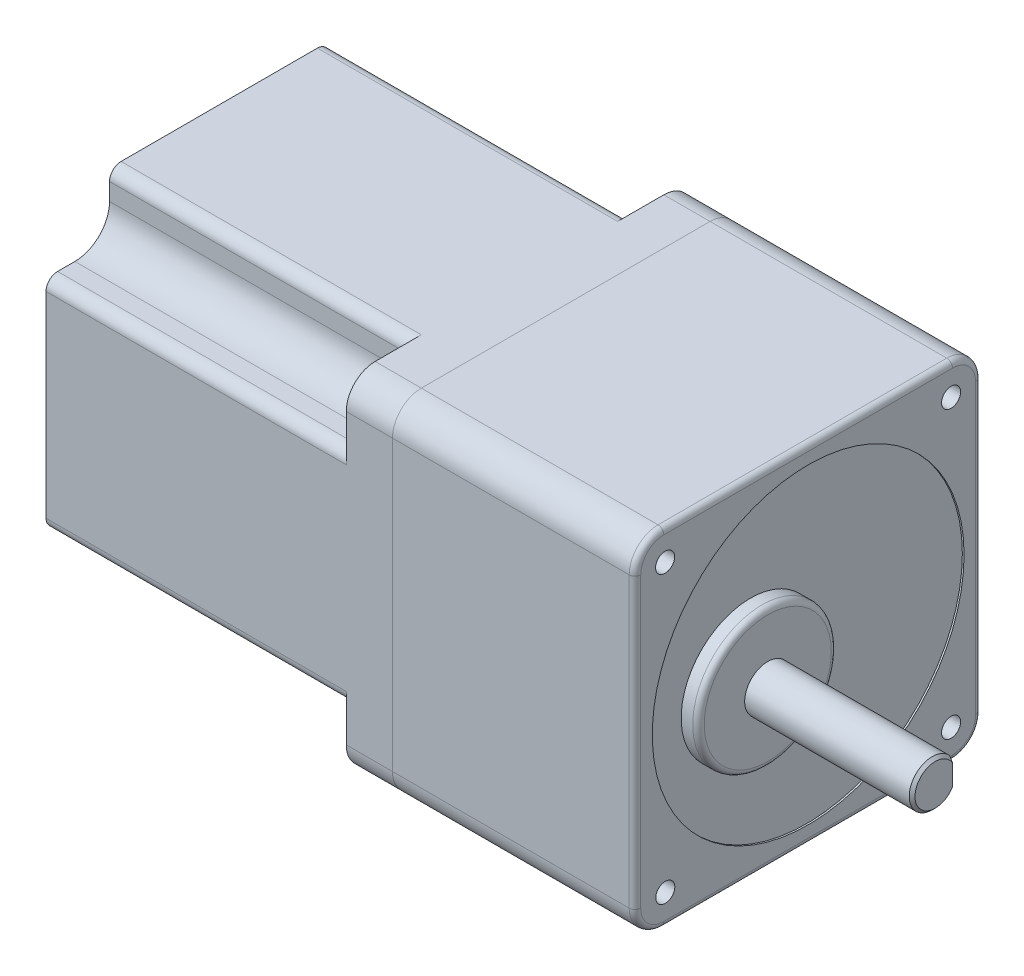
from build123d import *

# Parameters (mm, degrees)
EXTRUDE_1_DEPTH             = 8
SKETCH_3_R                  = 3
CUT_EXTRUDE_1_DEPTH         = 8
EXTRUDE_2_DEPTH             = 52
EXTRUDE_3_DEPTH             = 42
HOLE_WIZARD_M4_1_AT_2_COUNT = 2
HOLE_WIZARD_M4_1_AT_2_PITCH = 49.528083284
HOLE_WIZARD_M4_1_AT_3_COUNT = 2
HOLE_WIZARD_M4_1_AT_3_PITCH = 70.043273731
HOLE_WIZARD_M4_1_AT_4_COUNT = 2
HOLE_WIZARD_M4_1_AT_4_PITCH = 49.528083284
CUT_EXTRUDE_START           = -30
SKETCH_8_R                  = 3
CUT_EXTRUDE_2_DEPTH         = 30
SKETCH_9_R                  = 12
EXTRUDE_4_DEPTH             = 3
FILLET_1_R                  = 1
SKETCH_10_R                 = 4
EXTRUDE_5_DEPTH             = 29
CUT_EXTRUDE_3_DEPTH         = 25
CHAMFER_1_SIZE              = 0.5
SKETCH_12_R                 = 27
CUT_EXTRUDE_4_DEPTH         = 0.3
FILLET_2_R                  = 1


with BuildPart() as part:
    # Sketch 1 → Extrude 1 (new body)
    with BuildSketch(Plane(origin=(0, 0, 0), x_dir=(0, 0, -1), z_dir=(1, 0, 0))):
        with BuildLine():
            Line((-25, -30), (25, -30))
            ThreePointArc((25, -30), (28.535533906, -28.535533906), (30, -25))
            Line((30, -25), (30, 25))
            ThreePointArc((30, 25), (28.535533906, 28.535533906), (25, 30))
            Line((25, 30), (-25, 30))
            ThreePointArc((-25, 30), (-28.535533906, 28.535533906), (-30, 25))
            Line((-30, 25), (-30, -25))
            ThreePointArc((-30, -25), (-28.535533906, -28.535533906), (-25, -30))
        make_face()
    extrude(amount=-EXTRUDE_1_DEPTH)

    # Sketch 3 → Cut-Extrude 1 (cut)
    with BuildSketch(Plane(origin=(0, 0, 0), x_dir=(0, 0, -1), z_dir=(1, 0, 0))):
        with Locations((-24.748737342, 24.748737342)):
            Circle(SKETCH_3_R)
        with Locations((24.748737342, 24.748737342)):
            Circle(SKETCH_3_R)
        with Locations((24.748737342, -24.748737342)):
            Circle(SKETCH_3_R)
        with Locations((-24.748737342, -24.748737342)):
            Circle(SKETCH_3_R)
    extrude(amount=-CUT_EXTRUDE_1_DEPTH, mode=Mode.SUBTRACT)

    # Sketch 4 → Extrude 2 (add)
    with BuildSketch(Plane.ZY.offset(8)):
        with BuildLine():
            Line((-25, 19), (-28, 19))
            ThreePointArc((-28, 19), (-29.414213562, 18.414213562), (-30, 17))
            Line((-30, 17), (-30, -17))
            ThreePointArc((-30, -17), (-29.414213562, -18.414213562), (-28, -19))
            Line((-28, -19), (-25, -19))
            ThreePointArc((-25, -19), (-20.757359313, -20.757359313), (-19, -25))
            Line((-19, -25), (-19, -28))
            ThreePointArc((-19, -28), (-18.414213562, -29.414213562), (-17, -30))
            Line((-17, -30), (17, -30))
            ThreePointArc((17, -30), (18.414213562, -29.414213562), (19, -28))
            Line((19, -28), (19, -25))
            ThreePointArc((19, -25), (20.757359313, -20.757359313), (25, -19))
            Line((25, -19), (28, -19))
            ThreePointArc((28, -19), (29.414213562, -18.414213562), (30, -17))
            Line((30, -17), (30, 17))
            ThreePointArc((30, 17), (29.414213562, 18.414213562), (28, 19))
            Line((28, 19), (25, 19))
            ThreePointArc((25, 19), (20.757359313, 20.757359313), (19, 25))
            Line((19, 25), (19, 28))
            ThreePointArc((19, 28), (18.414213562, 29.414213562), (17, 30))
            Line((17, 30), (-17, 30))
            ThreePointArc((-17, 30), (-18.414213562, 29.414213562), (-19, 28))
            Line((-19, 28), (-19, 25))
            ThreePointArc((-19, 25), (-20.757359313, 20.757359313), (-25, 19))
        make_face()
    extrude(amount=EXTRUDE_2_DEPTH)


with BuildPart() as body_2:
    # Sketch 5 → Extrude 3 (new body)
    with BuildSketch(Plane(origin=(0, 0, 0), x_dir=(0, 0, -1), z_dir=(1, 0, 0))):
        with BuildLine():
            Line((-25, -30), (25, -30))
            ThreePointArc((25, -30), (28.535533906, -28.535533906), (30, -25))
            Line((30, -25), (30, 25))
            ThreePointArc((30, 25), (28.535533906, 28.535533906), (25, 30))
            Line((25, 30), (-25, 30))
            ThreePointArc((-25, 30), (-28.535533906, 28.535533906), (-30, 25))
            Line((-30, 25), (-30, -25))
            ThreePointArc((-30, -25), (-28.535533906, -28.535533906), (-25, -30))
        make_face()
    extrude(amount=EXTRUDE_3_DEPTH)

    # Sketch 7 → Hole Wizard M4 _1 (revolve, cut)
    with BuildSketch(Plane(origin=(42, 24.77933649, 24.77933649), x_dir=(0, 0, -1), z_dir=(0, 1, 0))):
        Polygon((0, 0), (0, 12.991420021), (1.65, 12), (1.65, 0), align=None)
    hole_wizard_m4_1 = revolve(axis=Axis((48.35, 24.77933649, 24.77933649), (-1, 0, 0)), mode=Mode.SUBTRACT)

    # Hole Wizard M4 _1 at 2: Hole Wizard M4 _1 ×2
    with Locations(*[Vector(0, -0.000617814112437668, -0.9999998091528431) * (i * HOLE_WIZARD_M4_1_AT_2_PITCH) for i in range(1, HOLE_WIZARD_M4_1_AT_2_COUNT)]):
        add(hole_wizard_m4_1, mode=Mode.SUBTRACT)

    # Hole Wizard M4 _1 at 3: Hole Wizard M4 _1 ×2
    with Locations(*[Vector(0, -0.7071067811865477, -0.7071067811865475) * (i * HOLE_WIZARD_M4_1_AT_3_PITCH) for i in range(1, HOLE_WIZARD_M4_1_AT_3_COUNT)]):
        add(hole_wizard_m4_1, mode=Mode.SUBTRACT)

    # Hole Wizard M4 _1 at 4: Hole Wizard M4 _1 ×2
    with Locations(*[Vector(0, -0.9999998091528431, -0.0006178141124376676) * (i * HOLE_WIZARD_M4_1_AT_4_PITCH) for i in range(1, HOLE_WIZARD_M4_1_AT_4_COUNT)]):
        add(hole_wizard_m4_1, mode=Mode.SUBTRACT)

    # Sketch 8 → Cut-Extrude 2 (cut)
    with BuildSketch(Plane.ZY.offset(CUT_EXTRUDE_START)):
        with Locations((-24.748737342, 24.748737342)):
            Circle(SKETCH_8_R)
        with Locations((24.748737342, 24.748737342)):
            Circle(SKETCH_8_R)
        with Locations((24.748737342, -24.748737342)):
            Circle(SKETCH_8_R)
        with Locations((-24.748737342, -24.748737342)):
            Circle(SKETCH_8_R)
    extrude(amount=CUT_EXTRUDE_2_DEPTH, mode=Mode.SUBTRACT)

    # Sketch 9 → Extrude 4 (add)
    with BuildSketch(Plane(origin=(42, 0, 0), x_dir=(0, 0, -1), z_dir=(1, 0, 0))):
        with Locations(Location((-10, 0, 0), (0, 0, 180))):
            Circle(SKETCH_9_R)
    extrude(amount=EXTRUDE_4_DEPTH)

    # Fillet 1
    fillet_1_edges = [body_2.edges().sort_by_distance(p)[0] for p in [
        (45, 0, -2),
    ]]
    fillet(fillet_1_edges, radius=FILLET_1_R)

    # Sketch 10 → Extrude 5 (add)
    with BuildSketch(Plane(origin=(45, 0, 0), x_dir=(0, 0, -1), z_dir=(1, 0, 0))):
        with Locations(Location((-10, 0, 0), (0, 0, 180))):
            Circle(SKETCH_10_R)
    extrude(amount=EXTRUDE_5_DEPTH)

    # Sketch 11 → Cut-Extrude 3 (cut)
    with BuildSketch(Plane(origin=(74, 0, 0), x_dir=(0, 0, -1), z_dir=(1, 0, 0))):
        with BuildLine():
            Line((-7, 2.645751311), (-7, -2.645751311))
            ThreePointArc((-7, -2.645751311), (-6, 0), (-7, 2.645751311))
        make_face()
    extrude(amount=-CUT_EXTRUDE_3_DEPTH, mode=Mode.SUBTRACT)

    # Chamfer 1
    chamfer_1_edges = [body_2.edges().sort_by_distance(p)[0] for p in [
        (74, 3.741657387, 11.414213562),
    ]]
    chamfer(chamfer_1_edges, length=CHAMFER_1_SIZE)

    # Sketch 12 → Cut-Extrude 4 (cut)
    with BuildSketch(Plane(origin=(42, 0, 0), x_dir=(0, 0, -1), z_dir=(1, 0, 0))):
        Circle(SKETCH_12_R)
    extrude(amount=-CUT_EXTRUDE_4_DEPTH, mode=Mode.SUBTRACT)


with BuildPart() as cut_extrude_4_piece_1:
    # of the separate pieces the step leaves, piece 1, a body of its own (cut_extrude_4_pieces)
    add(body_2.part.solids().sort_by_distance((42, -25, 30))[0])

    # Fillet 2
    fillet_2_edges = [cut_extrude_4_piece_1.edges().sort_by_distance(p)[0] for p in [
        (42, -28.535533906, 28.535533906),
        (42, -30, 0),
        (42, -28.535533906, -28.535533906),
        (42, 0, -30),
        (42, 28.535533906, -28.535533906),
        (42, 30, 0),
        (42, 28.535533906, 28.535533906),
        (42, 0, 30),
    ]]
    fillet(fillet_2_edges, radius=FILLET_2_R)


with BuildPart() as cut_extrude_4_piece_2:
    # of the separate pieces the step leaves, piece 2, a body of its own (cut_extrude_4_pieces)
    add(body_2.part.solids().sort_by_distance((73.5, 0, 14))[0])


solid = Compound([part.part, cut_extrude_4_piece_1.part, cut_extrude_4_piece_2.part])
